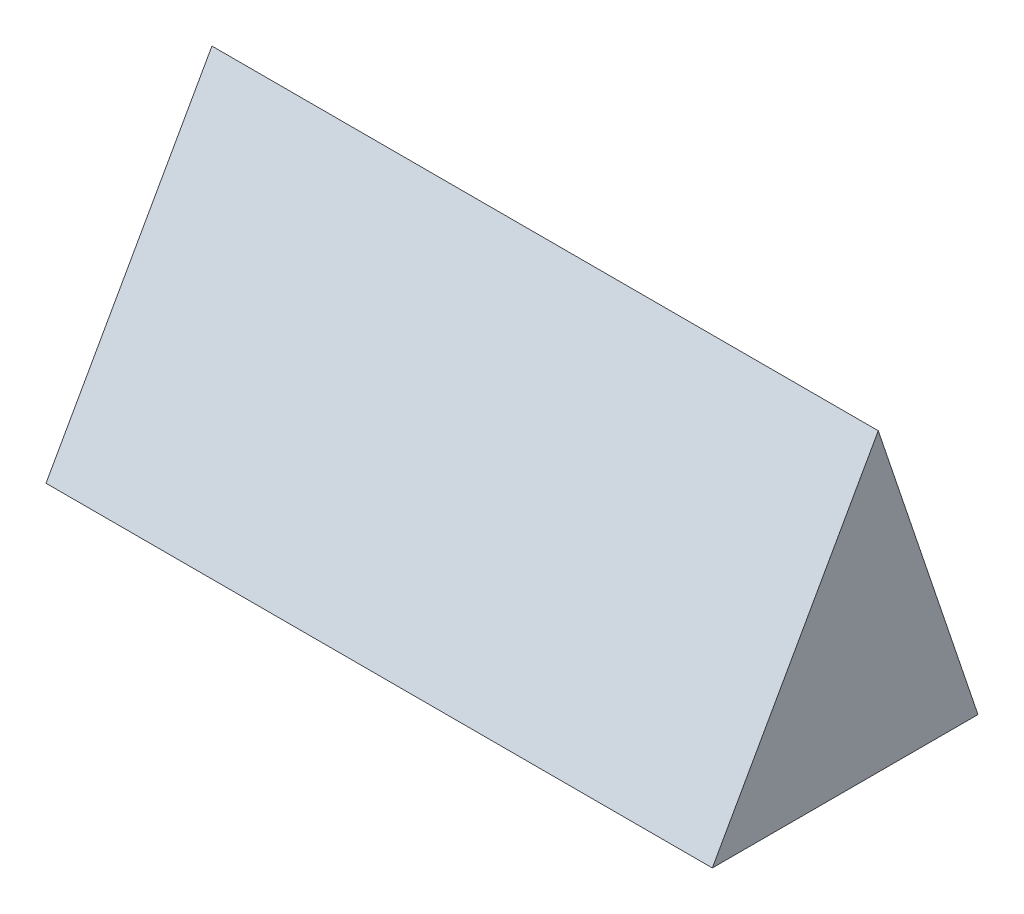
ISO-10303-21;
HEADER;
FILE_DESCRIPTION(('STEP AP214'),'2;1');
FILE_NAME('part.step','',(''),(''),'','','');
FILE_SCHEMA(('AUTOMOTIVE_DESIGN { 1 0 10303 214 1 1 1 1 }'));
ENDSEC;
DATA;
#1=APPLICATION_CONTEXT('core data for automotive mechanical design processes');
#2=APPLICATION_PROTOCOL_DEFINITION('international standard','automotive_design',2000,#1);
#3=PRODUCT_CONTEXT('',#1,'mechanical');
#4=PRODUCT('Part','Part','',(#3));
#5=PRODUCT_RELATED_PRODUCT_CATEGORY('part','',(#4));
#6=PRODUCT_DEFINITION_FORMATION('','',#4);
#7=PRODUCT_DEFINITION_CONTEXT('part definition',#1,'design');
#8=PRODUCT_DEFINITION('design','',#6,#7);
#9=PRODUCT_DEFINITION_SHAPE('','',#8);
#10=(LENGTH_UNIT() NAMED_UNIT(*) SI_UNIT(.MILLI.,.METRE.));
#11=(NAMED_UNIT(*) PLANE_ANGLE_UNIT() SI_UNIT($,.RADIAN.));
#12=(NAMED_UNIT(*) SI_UNIT($,.STERADIAN.) SOLID_ANGLE_UNIT());
#13=UNCERTAINTY_MEASURE_WITH_UNIT(LENGTH_MEASURE(1.E-05),#10,'distance_accuracy_value','');
#14=(GEOMETRIC_REPRESENTATION_CONTEXT(3) GLOBAL_UNCERTAINTY_ASSIGNED_CONTEXT((#13)) GLOBAL_UNIT_ASSIGNED_CONTEXT((#10,
#11,#12)) REPRESENTATION_CONTEXT('',''));
#15=CARTESIAN_POINT('',(0.,0.,0.));
#16=DIRECTION('',(0.,0.,1.));
#17=DIRECTION('',(1.,0.,0.));
#18=AXIS2_PLACEMENT_3D('',#15,#16,#17);
#19=CARTESIAN_POINT('',(148.821682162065,0.,-22.2763899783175));
#20=DIRECTION('',(0.,1.,0.));
#21=DIRECTION('',(0.,0.,1.));
#22=AXIS2_PLACEMENT_3D('',#19,#20,#21);
#23=PLANE('',#22);
#24=DIRECTION('',(0.,0.,-1.));
#25=VECTOR('',#24,1.);
#26=CARTESIAN_POINT('',(0.,0.,-22.2763899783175));
#27=LINE('',#26,#25);
#28=CARTESIAN_POINT('',(0.,0.,37.0611937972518));
#29=VERTEX_POINT('',#28);
#30=CARTESIAN_POINT('',(0.,0.,-22.2763899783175));
#31=VERTEX_POINT('',#30);
#32=EDGE_CURVE('E67',#29,#31,#27,.T.);
#33=ORIENTED_EDGE('',*,*,#32,.T.);
#34=DIRECTION('',(-1.,0.,0.));
#35=VECTOR('',#34,1.);
#36=CARTESIAN_POINT('',(148.821682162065,0.,-22.2763899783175));
#37=LINE('',#36,#35);
#38=CARTESIAN_POINT('',(148.821682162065,0.,-22.2763899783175));
#39=VERTEX_POINT('',#38);
#40=EDGE_CURVE('E11',#39,#31,#37,.T.);
#41=ORIENTED_EDGE('',*,*,#40,.F.);
#42=DIRECTION('',(0.,0.,-1.));
#43=VECTOR('',#42,1.);
#44=CARTESIAN_POINT('',(148.821682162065,0.,-22.2763899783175));
#45=LINE('',#44,#43);
#46=CARTESIAN_POINT('',(148.821682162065,0.,37.0611937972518));
#47=VERTEX_POINT('',#46);
#48=EDGE_CURVE('E81',#47,#39,#45,.T.);
#49=ORIENTED_EDGE('',*,*,#48,.F.);
#50=DIRECTION('',(-1.,0.,0.));
#51=VECTOR('',#50,1.);
#52=CARTESIAN_POINT('',(148.821682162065,0.,37.0611937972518));
#53=LINE('',#52,#51);
#54=EDGE_CURVE('E77',#47,#29,#53,.T.);
#55=ORIENTED_EDGE('',*,*,#54,.T.);
#56=EDGE_LOOP('',(#33,#41,#49,#55));
#57=FACE_BOUND('',#56,.T.);
#58=ADVANCED_FACE('F31',(#57),#23,.F.);
#59=CARTESIAN_POINT('',(148.821682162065,66.04,0.));
#60=DIRECTION('',(0.,-0.319622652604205,0.947544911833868));
#61=DIRECTION('',(0.,-0.947544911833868,-0.319622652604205));
#62=AXIS2_PLACEMENT_3D('',#59,#60,#61);
#63=PLANE('',#62);
#64=DIRECTION('',(0.,0.947544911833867,0.319622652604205));
#65=VECTOR('',#64,1.);
#66=CARTESIAN_POINT('',(0.,66.04,0.));
#67=LINE('',#66,#65);
#68=CARTESIAN_POINT('',(0.,66.04,0.));
#69=VERTEX_POINT('',#68);
#70=EDGE_CURVE('E64',#31,#69,#67,.T.);
#71=ORIENTED_EDGE('',*,*,#70,.T.);
#72=DIRECTION('',(-1.,0.,0.));
#73=VECTOR('',#72,1.);
#74=CARTESIAN_POINT('',(148.821682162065,66.04,0.));
#75=LINE('',#74,#73);
#76=CARTESIAN_POINT('',(148.821682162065,66.04,0.));
#77=VERTEX_POINT('',#76);
#78=EDGE_CURVE('E38',#77,#69,#75,.T.);
#79=ORIENTED_EDGE('',*,*,#78,.F.);
#80=DIRECTION('',(0.,0.947544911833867,0.319622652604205));
#81=VECTOR('',#80,1.);
#82=CARTESIAN_POINT('',(148.821682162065,66.04,0.));
#83=LINE('',#82,#81);
#84=EDGE_CURVE('E49',#39,#77,#83,.T.);
#85=ORIENTED_EDGE('',*,*,#84,.F.);
#86=ORIENTED_EDGE('',*,*,#40,.T.);
#87=EDGE_LOOP('',(#71,#79,#85,#86));
#88=FACE_BOUND('',#87,.T.);
#89=ADVANCED_FACE('F73',(#88),#63,.F.);
#90=CARTESIAN_POINT('',(148.821682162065,0.,37.0611937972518));
#91=DIRECTION('',(0.,-0.489395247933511,-0.872062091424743));
#92=DIRECTION('',(0.,0.872062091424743,-0.489395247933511));
#93=AXIS2_PLACEMENT_3D('',#90,#91,#92);
#94=PLANE('',#93);
#95=DIRECTION('',(0.,-0.872062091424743,0.489395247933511));
#96=VECTOR('',#95,1.);
#97=CARTESIAN_POINT('',(0.,0.,37.0611937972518));
#98=LINE('',#97,#96);
#99=EDGE_CURVE('E68',#69,#29,#98,.T.);
#100=ORIENTED_EDGE('',*,*,#99,.T.);
#101=ORIENTED_EDGE('',*,*,#54,.F.);
#102=DIRECTION('',(0.,-0.872062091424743,0.489395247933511));
#103=VECTOR('',#102,1.);
#104=CARTESIAN_POINT('',(148.821682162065,0.,37.0611937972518));
#105=LINE('',#104,#103);
#106=EDGE_CURVE('E45',#77,#47,#105,.T.);
#107=ORIENTED_EDGE('',*,*,#106,.F.);
#108=ORIENTED_EDGE('',*,*,#78,.T.);
#109=EDGE_LOOP('',(#100,#101,#107,#108));
#110=FACE_BOUND('',#109,.T.);
#111=ADVANCED_FACE('F86',(#110),#94,.F.);
#112=CARTESIAN_POINT('',(148.821682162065,0.,-22.2763899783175));
#113=DIRECTION('',(1.,0.,0.));
#114=DIRECTION('',(0.,0.,-1.));
#115=AXIS2_PLACEMENT_3D('',#112,#113,#114);
#116=PLANE('',#115);
#117=ORIENTED_EDGE('',*,*,#48,.T.);
#118=ORIENTED_EDGE('',*,*,#84,.T.);
#119=ORIENTED_EDGE('',*,*,#106,.T.);
#120=EDGE_LOOP('',(#117,#118,#119));
#121=FACE_BOUND('',#120,.T.);
#122=ADVANCED_FACE('F87',(#121),#116,.T.);
#123=CARTESIAN_POINT('',(0.,0.,-22.2763899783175));
#124=DIRECTION('',(1.,0.,0.));
#125=DIRECTION('',(0.,0.,-1.));
#126=AXIS2_PLACEMENT_3D('',#123,#124,#125);
#127=PLANE('',#126);
#128=ORIENTED_EDGE('',*,*,#32,.F.);
#129=ORIENTED_EDGE('',*,*,#99,.F.);
#130=ORIENTED_EDGE('',*,*,#70,.F.);
#131=EDGE_LOOP('',(#128,#129,#130));
#132=FACE_BOUND('',#131,.T.);
#133=ADVANCED_FACE('F65',(#132),#127,.F.);
#134=CLOSED_SHELL('',(#58,#89,#111,#122,#133));
#135=MANIFOLD_SOLID_BREP('B2',#134);
#136=ADVANCED_BREP_SHAPE_REPRESENTATION('',(#18,#135),#14);
#137=SHAPE_DEFINITION_REPRESENTATION(#9,#136);
ENDSEC;
END-ISO-10303-21;
